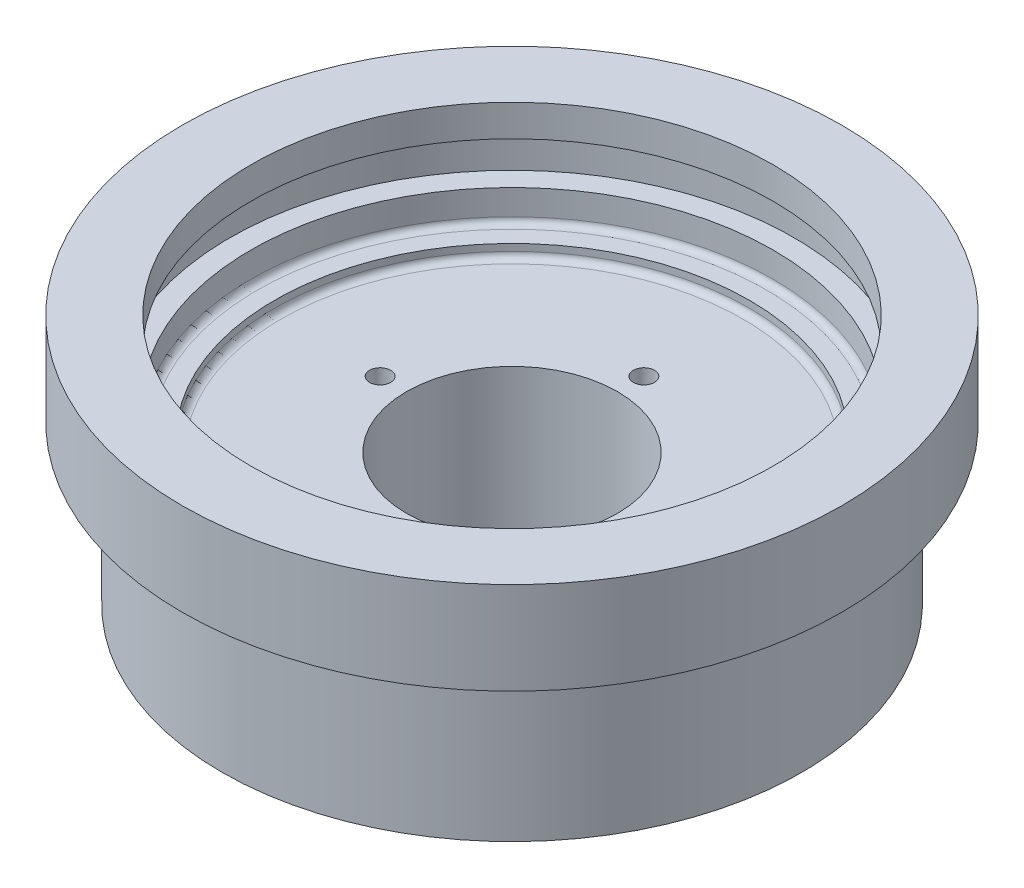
from build123d import *

# Parameters (mm, degrees)
SKETCH2_R          = 2.54
CUT_EXTRUDE1_DEPTH = 118.560779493
CIRPATTERN1_COUNT  = 4


with BuildPart() as part:
    # Sketch1 → Base-Revolve (revolve)
    with BuildSketch(Plane.XY, mode=Mode.PRIVATE) as base_revolve_sk:
        with BuildLine():
            Line((62.865, 0), (79.375, 0))
            Line((79.375, 0), (79.375, -22.225))
            Line((79.375, -22.225), (71.374, -22.225))
            ThreePointArc((71.374, -22.225), (70.296369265, -22.671369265), (69.85, -23.749))
            Line((69.85, -23.749), (69.85, -60.325))
            Line((69.85, -60.325), (64.516, -60.325))
            ThreePointArc((64.516, -60.325), (63.438369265, -60.771369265), (62.992, -61.849))
            Line((62.992, -61.849), (62.992, -63.5))
            Line((62.992, -63.5), (41.275, -63.5))
            Line((41.275, -63.5), (41.275, -60.6806))
            Line((41.275, -60.6806), (36.5252, -60.6806))
            Line((36.5252, -60.6806), (36.5252, -63.5))
            Line((36.5252, -63.5), (25.4, -63.5))
            Line((25.4, -63.5), (25.4, -28.575))
            Line((25.4, -28.575), (55.626, -28.575))
            ThreePointArc((55.626, -28.575), (56.703630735, -28.128630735), (57.15, -27.051))
            Line((57.15, -27.051), (57.15, -25.4))
            Line((57.15, -25.4), (61.341, -25.4))
            ThreePointArc((61.341, -25.4), (62.418630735, -24.953630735), (62.865, -23.876))
            Line((62.865, -23.876), (62.865, -17.78))
            Line((62.865, -17.78), (67.945, -17.78))
            Line((67.945, -17.78), (67.945, -7.62))
            Line((67.945, -7.62), (62.865, -7.62))
            Line((62.865, -7.62), (62.865, 0))
        make_face()
    revolve(base_revolve_sk.sketch.rotate(Axis((0, 88.7095, 0), (0, -1, 0)), 90), axis=Axis((0, 88.7095, 0), (0, -1, 0)))

    # Sketch2 → Cut-Extrude1 (cut, through all)
    with BuildSketch(Plane(origin=(0, -28.575, 0), x_dir=(-1, 0, 0), z_dir=(0, 1, 0))):
        with Locations(Location((0, 31.75, 0), (0, 0, 90))):
            Circle(SKETCH2_R)
    cut_extrude1 = extrude(amount=-CUT_EXTRUDE1_DEPTH, mode=Mode.SUBTRACT)

    # CirPattern1: Cut-Extrude1 ×4 about axis
    cirpattern1_axis = Axis((0, 88.7095, 0), (0, -1, 0))
    for i in range(1, CIRPATTERN1_COUNT):
        add(cut_extrude1.rotate(cirpattern1_axis, i * 360 / CIRPATTERN1_COUNT), mode=Mode.SUBTRACT)


solid = part.part
